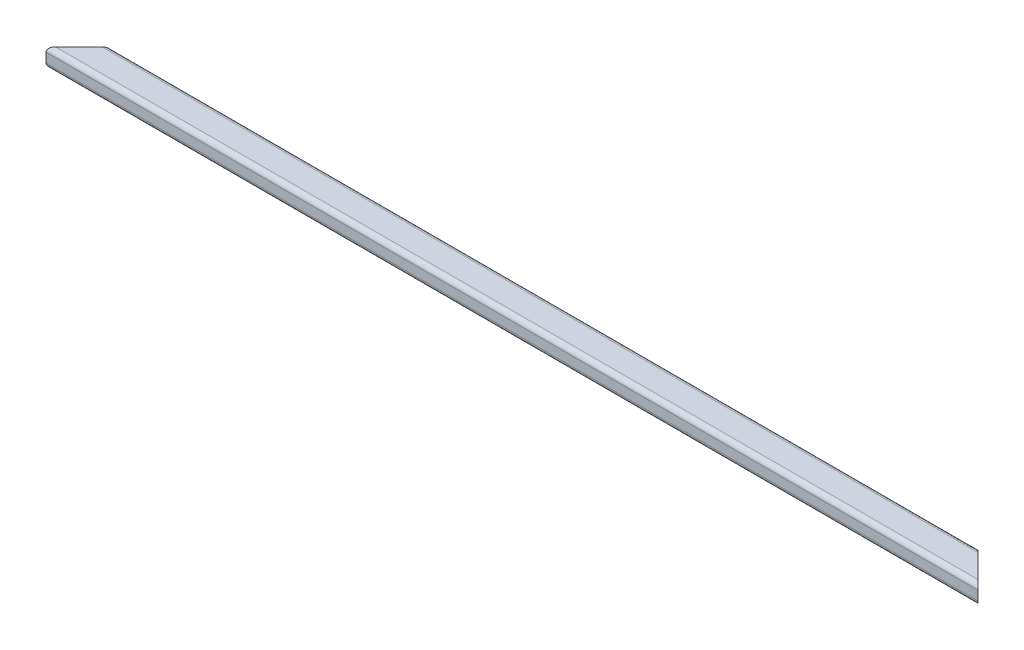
from build123d import *

# Parameters (mm, degrees)
BASE_EXTRUSION_DEPTH    = 1000
ENL_V_MAT_EXTRU_1_DEPTH = 1001.353062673


with BuildPart() as part:
    # Esquisse1 → Base-Extrusion (new body)
    with BuildSketch(Plane(origin=(0, 0, 0), x_dir=(0, 0, -1), z_dir=(1, 0, 0))):
        with BuildLine():
            Line((-12.5, 10), (12.5, 10))
            ThreePointArc((12.5, 10), (16.035533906, 8.535533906), (17.5, 5))
            Line((17.5, 5), (17.5, -5))
            ThreePointArc((17.5, -5), (16.035533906, -8.535533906), (12.5, -10))
            Line((12.5, -10), (-12.5, -10))
            ThreePointArc((-12.5, -10), (-16.035533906, -8.535533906), (-17.5, -5))
            Line((-17.5, -5), (-17.5, 5))
            ThreePointArc((-17.5, 5), (-16.035533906, 8.535533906), (-12.5, 10))
        make_face()
        with BuildLine():
            Line((-12.5, 7.5), (12.5, 7.5))
            ThreePointArc((12.5, 7.5), (14.267766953, 6.767766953), (15, 5))
            Line((15, 5), (15, -5))
            ThreePointArc((15, -5), (14.267766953, -6.767766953), (12.5, -7.5))
            Line((12.5, -7.5), (-12.5, -7.5))
            ThreePointArc((-12.5, -7.5), (-14.267766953, -6.767766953), (-15, -5))
            Line((-15, -5), (-15, 5))
            ThreePointArc((-15, 5), (-14.267766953, 6.767766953), (-12.5, 7.5))
        make_face(mode=Mode.SUBTRACT)
    extrude(amount=BASE_EXTRUSION_DEPTH)

    # Esquisse2 → Enl_v. mat.-Extru.1 (cut, through all)
    with BuildSketch(Plane(origin=(0, 10, 0), x_dir=(-1, 0, 0), z_dir=(0, 1, 0))):
        Polygon((-1000, 17.5), (-965, -17.5), (-1000, -17.5), align=None)
        Polygon((0, 17.5), (-35, -17.5), (0, -17.5), align=None)
    extrude(amount=-ENL_V_MAT_EXTRU_1_DEPTH, mode=Mode.SUBTRACT)


solid = part.part
